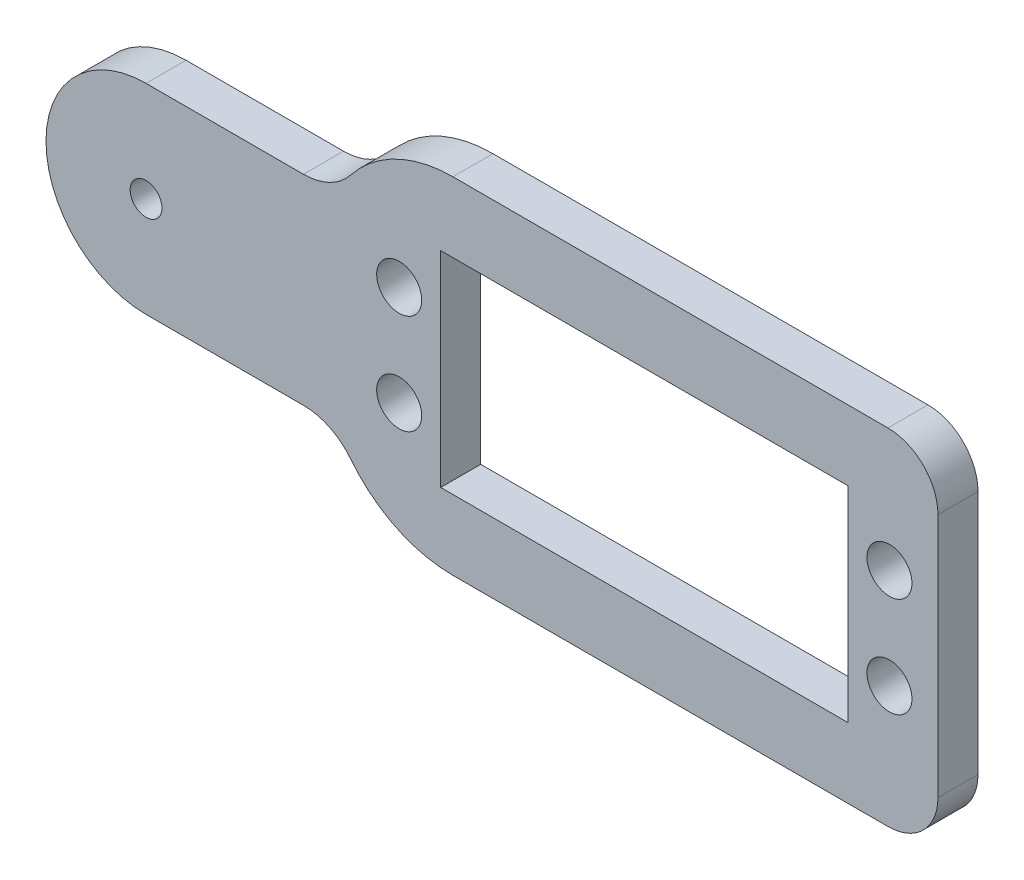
from build123d import *

# Parameters (mm, degrees)
SKETCH1_R           = 1.59
SKETCH1_R_2         = 2.25
SKETCH1_W           = 40.7
SKETCH1_H           = 20.5
BOSS_EXTRUDE1_DEPTH = 4


with BuildPart() as part:
    # Sketch1 → Boss-Extrude1 (new body)
    with BuildSketch(Plane.XY):
        with BuildLine():
            Line((29.35, -12.25), (29.35, 12.25))
            ThreePointArc((29.35, 12.25), (27.885533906, 15.785533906), (24.35, 17.25))
            Line((24.35, 17.25), (-19.133989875, 17.25))
            ThreePointArc((-19.133989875, 17.25), (-24.812318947, 15.944296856), (-29.35, 12.289473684))
            ThreePointArc((-29.35, 12.289473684), (-31.444314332, 10.60263222), (-34.065081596, 10))
            Line((-34.065081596, 10), (-49.8, 10))
            ThreePointArc((-49.8, 10), (-59.8, 0), (-49.8, -10))
            Line((-49.8, -10), (-34.065081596, -10))
            ThreePointArc((-34.065081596, -10), (-31.444314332, -10.60263222), (-29.35, -12.289473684))
            ThreePointArc((-29.35, -12.289473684), (-24.812318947, -15.944296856), (-19.133989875, -17.25))
            Line((-19.133989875, -17.25), (24.35, -17.25))
            ThreePointArc((24.35, -17.25), (27.885533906, -15.785533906), (29.35, -12.25))
        make_face()
        with Locations((-49.8, 0)):
            Circle(SKETCH1_R, mode=Mode.SUBTRACT)
        with Locations((-24.5, -5)):
            Circle(SKETCH1_R_2, mode=Mode.SUBTRACT)
        with Locations((24.5, -5)):
            Circle(SKETCH1_R_2, mode=Mode.SUBTRACT)
        with Locations((24.5, 5)):
            Circle(SKETCH1_R_2, mode=Mode.SUBTRACT)
        with Locations((-24.5, 5)):
            Circle(SKETCH1_R_2, mode=Mode.SUBTRACT)
        Rectangle(SKETCH1_W, SKETCH1_H, mode=Mode.SUBTRACT)
    extrude(amount=BOSS_EXTRUDE1_DEPTH)


solid = part.part
